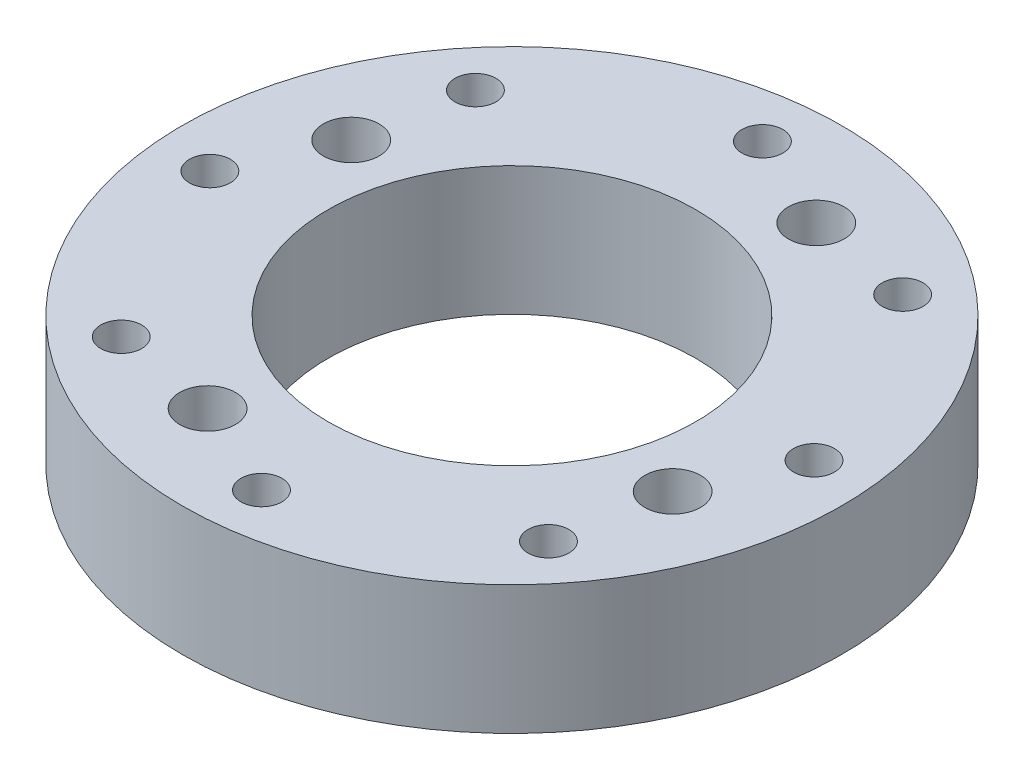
from build123d import *

# Parameters (mm, degrees)
SKETCH1_R                      = 32.5
SKETCH1_R_2                    = 18.127
BOSS_EXTRUDE1_DEPTH            = 12.7
CBORE_FOR_M5_SHCS1_D           = 5.5
CBORE_FOR_M5_SHCS1_CBORE_D     = 10
CBORE_FOR_M5_SHCS1_CBORE_DEPTH = 6.778
CIRPATTERN3_COUNT              = 4
F_10_32_TAPPED_HOLE1_D         = 4.0386
CIRPATTERN2_COUNT              = 8


with BuildPart() as part:
    # Sketch1 → Boss-Extrude1 (new body)
    with BuildSketch(Plane(origin=(0, 0, 0), x_dir=(1, 0, 0), z_dir=(0, 1, 0))):
        with Locations(Location((0, 0, 0), (0, 0, 270))):
            Circle(SKETCH1_R)
        with Locations(Location((0, 0, 0), (0, 0, 270))):
            Circle(SKETCH1_R_2, mode=Mode.SUBTRACT)
    extrude(amount=BOSS_EXTRUDE1_DEPTH)

    # CBORE for M5 SHCS1 (through all)
    with Locations(Plane(origin=(0, 0, 0), x_dir=(-1, 0, 0), z_dir=(0, -1, 0))):
        with Locations((7.081838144, -22.931366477)):
            cbore_for_m5_shcs1 = CounterBoreHole(CBORE_FOR_M5_SHCS1_D / 2, CBORE_FOR_M5_SHCS1_CBORE_D / 2, CBORE_FOR_M5_SHCS1_CBORE_DEPTH)

    # CirPattern3: CBORE for M5 SHCS1 ×4 about axis
    cirpattern3_axis = Axis((0, 0, 0), (0, 1, 0))
    for i in range(1, CIRPATTERN3_COUNT):
        add(cbore_for_m5_shcs1.rotate(cirpattern3_axis, i * 360 / CIRPATTERN3_COUNT), mode=Mode.SUBTRACT)

    # 10-32 Tapped Hole1 (through all)
    with Locations(Plane(origin=(0, 0, 0), x_dir=(-1, 0, 0), z_dir=(0, -1, 0))):
        with Locations((-2.545497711, -27.243840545)):
            f_10_32_tapped_hole1 = Hole(F_10_32_TAPPED_HOLE1_D / 2)

    # CirPattern2: 10-32 Tapped Hole1 ×8 about axis
    cirpattern2_axis = Axis((0, 0, 0), (0, 1, 0))
    for i in range(1, CIRPATTERN2_COUNT):
        add(f_10_32_tapped_hole1.rotate(cirpattern2_axis, i * 360 / CIRPATTERN2_COUNT), mode=Mode.SUBTRACT)


solid = part.part
